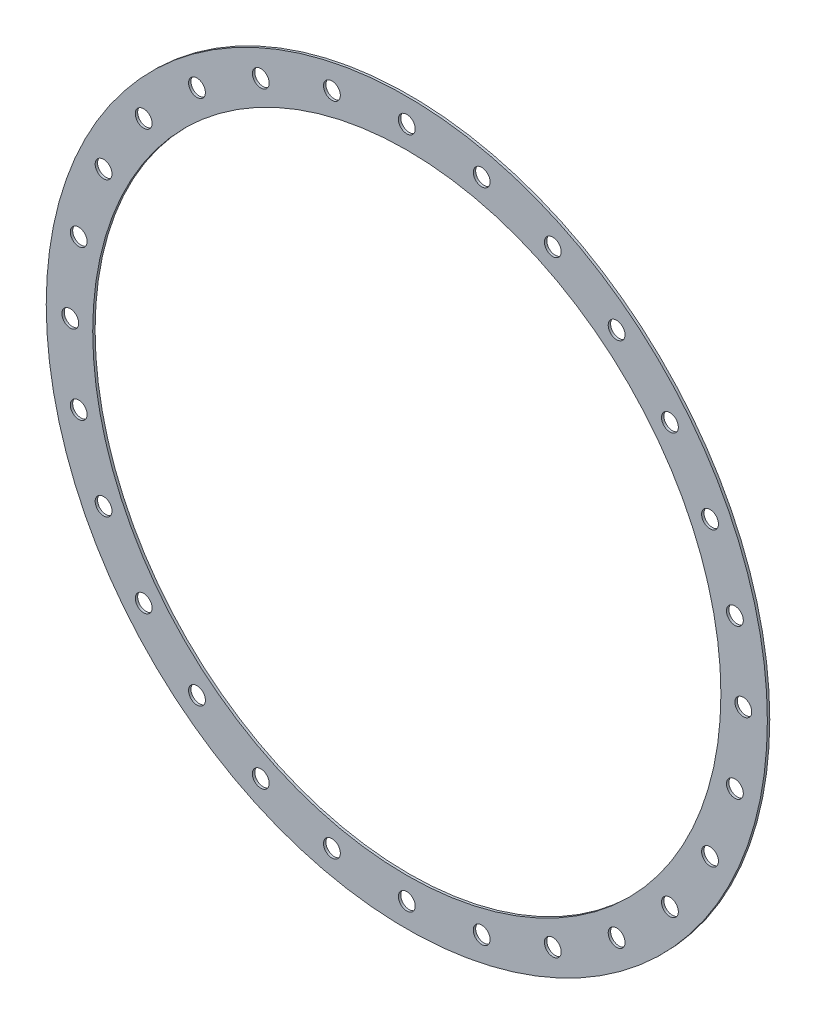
ISO-10303-21;
HEADER;
FILE_DESCRIPTION(('STEP AP214'),'2;1');
FILE_NAME('part.step','',(''),(''),'','','');
FILE_SCHEMA(('AUTOMOTIVE_DESIGN { 1 0 10303 214 1 1 1 1 }'));
ENDSEC;
DATA;
#1=APPLICATION_CONTEXT('core data for automotive mechanical design processes');
#2=APPLICATION_PROTOCOL_DEFINITION('international standard','automotive_design',2000,#1);
#3=PRODUCT_CONTEXT('',#1,'mechanical');
#4=PRODUCT('Part','Part','',(#3));
#5=PRODUCT_RELATED_PRODUCT_CATEGORY('part','',(#4));
#6=PRODUCT_DEFINITION_FORMATION('','',#4);
#7=PRODUCT_DEFINITION_CONTEXT('part definition',#1,'design');
#8=PRODUCT_DEFINITION('design','',#6,#7);
#9=PRODUCT_DEFINITION_SHAPE('','',#8);
#10=(LENGTH_UNIT() NAMED_UNIT(*) SI_UNIT(.MILLI.,.METRE.));
#11=(NAMED_UNIT(*) PLANE_ANGLE_UNIT() SI_UNIT($,.RADIAN.));
#12=(NAMED_UNIT(*) SI_UNIT($,.STERADIAN.) SOLID_ANGLE_UNIT());
#13=UNCERTAINTY_MEASURE_WITH_UNIT(LENGTH_MEASURE(1.E-05),#10,'distance_accuracy_value','');
#14=(GEOMETRIC_REPRESENTATION_CONTEXT(3) GLOBAL_UNCERTAINTY_ASSIGNED_CONTEXT((#13)) GLOBAL_UNIT_ASSIGNED_CONTEXT((#10,
#11,#12)) REPRESENTATION_CONTEXT('',''));
#15=CARTESIAN_POINT('',(0.,0.,0.));
#16=DIRECTION('',(0.,0.,1.));
#17=DIRECTION('',(1.,0.,0.));
#18=AXIS2_PLACEMENT_3D('',#15,#16,#17);
#19=CARTESIAN_POINT('',(0.,0.,1.5));
#20=DIRECTION('',(0.,0.,1.));
#21=DIRECTION('',(1.,0.,0.));
#22=AXIS2_PLACEMENT_3D('',#19,#20,#21);
#23=PLANE('',#22);
#24=CARTESIAN_POINT('',(46.7293961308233,204.734861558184,1.5));
#25=DIRECTION('',(0.,0.,1.));
#26=DIRECTION('',(0.974927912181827,-0.222520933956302,0.));
#27=AXIS2_PLACEMENT_3D('',#24,#25,#26);
#28=CIRCLE('',#27,5.25);
#29=CARTESIAN_POINT('',(51.8477676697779,203.566626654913,1.5));
#30=VERTEX_POINT('',#29);
#31=EDGE_CURVE('E210',#30,#30,#28,.T.);
#32=ORIENTED_EDGE('',*,*,#31,.F.);
#33=EDGE_LOOP('',(#32));
#34=FACE_BOUND('',#33,.T.);
#35=CARTESIAN_POINT('',(91.1155852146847,189.203462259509,1.5));
#36=DIRECTION('',(0.,0.,1.));
#37=DIRECTION('',(0.900968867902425,-0.433883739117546,0.));
#38=AXIS2_PLACEMENT_3D('',#35,#36,#37);
#39=CIRCLE('',#38,5.25);
#40=CARTESIAN_POINT('',(95.8456717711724,186.925572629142,1.5));
#41=VERTEX_POINT('',#40);
#42=EDGE_CURVE('E204',#41,#41,#39,.T.);
#43=ORIENTED_EDGE('',*,*,#42,.F.);
#44=EDGE_LOOP('',(#43));
#45=FACE_BOUND('',#44,.T.);
#46=CARTESIAN_POINT('',(130.932858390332,164.184611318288,1.5));
#47=DIRECTION('',(0.,0.,1.));
#48=DIRECTION('',(0.781831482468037,-0.623489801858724,0.));
#49=AXIS2_PLACEMENT_3D('',#46,#47,#48);
#50=CIRCLE('',#49,5.25);
#51=CARTESIAN_POINT('',(135.037473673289,160.91128985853,1.5));
#52=VERTEX_POINT('',#51);
#53=EDGE_CURVE('E198',#52,#52,#50,.T.);
#54=ORIENTED_EDGE('',*,*,#53,.F.);
#55=EDGE_LOOP('',(#54));
#56=FACE_BOUND('',#55,.T.);
#57=CARTESIAN_POINT('',(164.184611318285,130.932858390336,1.5));
#58=DIRECTION('',(0.,0.,1.));
#59=DIRECTION('',(0.623489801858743,-0.781831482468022,0.));
#60=AXIS2_PLACEMENT_3D('',#57,#58,#59);
#61=CIRCLE('',#60,5.25);
#62=CARTESIAN_POINT('',(167.457932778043,126.828243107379,1.5));
#63=VERTEX_POINT('',#62);
#64=EDGE_CURVE('E192',#63,#63,#61,.T.);
#65=ORIENTED_EDGE('',*,*,#64,.F.);
#66=EDGE_LOOP('',(#65));
#67=FACE_BOUND('',#66,.T.);
#68=CARTESIAN_POINT('',(189.203462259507,91.1155852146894,1.5));
#69=DIRECTION('',(0.,0.,1.));
#70=DIRECTION('',(0.433883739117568,-0.900968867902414,0.));
#71=AXIS2_PLACEMENT_3D('',#68,#69,#70);
#72=CIRCLE('',#71,5.25);
#73=CARTESIAN_POINT('',(191.481351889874,86.3854986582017,1.5));
#74=VERTEX_POINT('',#73);
#75=EDGE_CURVE('E186',#74,#74,#72,.T.);
#76=ORIENTED_EDGE('',*,*,#75,.F.);
#77=EDGE_LOOP('',(#76));
#78=FACE_BOUND('',#77,.T.);
#79=CARTESIAN_POINT('',(204.734861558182,46.7293961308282,1.5));
#80=DIRECTION('',(0.,0.,1.));
#81=DIRECTION('',(0.222520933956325,-0.974927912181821,0.));
#82=AXIS2_PLACEMENT_3D('',#79,#80,#81);
#83=CIRCLE('',#82,5.25);
#84=CARTESIAN_POINT('',(205.903096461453,41.6110245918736,1.5));
#85=VERTEX_POINT('',#84);
#86=EDGE_CURVE('E180',#85,#85,#83,.T.);
#87=ORIENTED_EDGE('',*,*,#86,.F.);
#88=EDGE_LOOP('',(#87));
#89=FACE_BOUND('',#88,.T.);
#90=CARTESIAN_POINT('',(210.,2.19963324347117E-12,1.5));
#91=DIRECTION('',(0.,0.,1.));
#92=DIRECTION('',(0.,-1.,0.));
#93=AXIS2_PLACEMENT_3D('',#90,#91,#92);
#94=CIRCLE('',#93,5.25);
#95=CARTESIAN_POINT('',(210.,-5.2499999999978,1.5));
#96=VERTEX_POINT('',#95);
#97=EDGE_CURVE('E174',#96,#96,#94,.T.);
#98=ORIENTED_EDGE('',*,*,#97,.F.);
#99=EDGE_LOOP('',(#98));
#100=FACE_BOUND('',#99,.T.);
#101=CARTESIAN_POINT('',(204.734861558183,-46.7293961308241,1.5));
#102=DIRECTION('',(0.,0.,1.));
#103=DIRECTION('',(-0.222520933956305,-0.974927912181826,0.));
#104=AXIS2_PLACEMENT_3D('',#101,#102,#103);
#105=CIRCLE('',#104,5.25);
#106=CARTESIAN_POINT('',(203.566626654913,-51.8477676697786,1.5));
#107=VERTEX_POINT('',#106);
#108=EDGE_CURVE('E168',#107,#107,#105,.T.);
#109=ORIENTED_EDGE('',*,*,#108,.F.);
#110=EDGE_LOOP('',(#109));
#111=FACE_BOUND('',#110,.T.);
#112=CARTESIAN_POINT('',(189.203462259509,-91.1155852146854,1.5));
#113=DIRECTION('',(0.,0.,1.));
#114=DIRECTION('',(-0.433883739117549,-0.900968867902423,0.));
#115=AXIS2_PLACEMENT_3D('',#112,#113,#114);
#116=CIRCLE('',#115,5.25);
#117=CARTESIAN_POINT('',(186.925572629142,-95.8456717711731,1.5));
#118=VERTEX_POINT('',#117);
#119=EDGE_CURVE('E162',#118,#118,#116,.T.);
#120=ORIENTED_EDGE('',*,*,#119,.F.);
#121=EDGE_LOOP('',(#120));
#122=FACE_BOUND('',#121,.T.);
#123=CARTESIAN_POINT('',(164.184611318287,-130.932858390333,1.5));
#124=DIRECTION('',(0.,0.,1.));
#125=DIRECTION('',(-0.623489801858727,-0.781831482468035,0.));
#126=AXIS2_PLACEMENT_3D('',#123,#124,#125);
#127=CIRCLE('',#126,5.25);
#128=CARTESIAN_POINT('',(160.911289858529,-135.03747367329,1.5));
#129=VERTEX_POINT('',#128);
#130=EDGE_CURVE('E156',#129,#129,#127,.T.);
#131=ORIENTED_EDGE('',*,*,#130,.F.);
#132=EDGE_LOOP('',(#131));
#133=FACE_BOUND('',#132,.T.);
#134=CARTESIAN_POINT('',(130.932858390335,-164.184611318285,1.5));
#135=DIRECTION('',(0.,0.,1.));
#136=DIRECTION('',(-0.781831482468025,-0.62348980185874,0.));
#137=AXIS2_PLACEMENT_3D('',#134,#135,#136);
#138=CIRCLE('',#137,5.25);
#139=CARTESIAN_POINT('',(126.828243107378,-167.457932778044,1.5));
#140=VERTEX_POINT('',#139);
#141=EDGE_CURVE('E150',#140,#140,#138,.T.);
#142=ORIENTED_EDGE('',*,*,#141,.F.);
#143=EDGE_LOOP('',(#142));
#144=FACE_BOUND('',#143,.T.);
#145=CARTESIAN_POINT('',(91.1155852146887,-189.203462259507,1.5));
#146=DIRECTION('',(0.,0.,1.));
#147=DIRECTION('',(-0.900968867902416,-0.433883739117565,0.));
#148=AXIS2_PLACEMENT_3D('',#145,#146,#147);
#149=CIRCLE('',#148,5.25);
#150=CARTESIAN_POINT('',(86.385498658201,-191.481351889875,1.5));
#151=VERTEX_POINT('',#150);
#152=EDGE_CURVE('E144',#151,#151,#149,.T.);
#153=ORIENTED_EDGE('',*,*,#152,.F.);
#154=EDGE_LOOP('',(#153));
#155=FACE_BOUND('',#154,.T.);
#156=CARTESIAN_POINT('',(46.7293961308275,-204.734861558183,1.5));
#157=DIRECTION('',(0.,0.,1.));
#158=DIRECTION('',(-0.974927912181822,-0.222520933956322,0.));
#159=AXIS2_PLACEMENT_3D('',#156,#157,#158);
#160=CIRCLE('',#159,5.25);
#161=CARTESIAN_POINT('',(41.611024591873,-205.903096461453,1.5));
#162=VERTEX_POINT('',#161);
#163=EDGE_CURVE('E138',#162,#162,#160,.T.);
#164=ORIENTED_EDGE('',*,*,#163,.F.);
#165=EDGE_LOOP('',(#164));
#166=FACE_BOUND('',#165,.T.);
#167=CARTESIAN_POINT('',(0.,-210.,1.5));
#168=DIRECTION('',(0.,0.,1.));
#169=DIRECTION('',(-1.,0.,0.));
#170=AXIS2_PLACEMENT_3D('',#167,#168,#169);
#171=CIRCLE('',#170,5.25);
#172=CARTESIAN_POINT('',(-5.25,-210.,1.5));
#173=VERTEX_POINT('',#172);
#174=EDGE_CURVE('E132',#173,#173,#171,.T.);
#175=ORIENTED_EDGE('',*,*,#174,.F.);
#176=EDGE_LOOP('',(#175));
#177=FACE_BOUND('',#176,.T.);
#178=CARTESIAN_POINT('',(-46.7293961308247,-204.734861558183,1.5));
#179=DIRECTION('',(0.,0.,1.));
#180=DIRECTION('',(-0.974927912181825,0.222520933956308,0.));
#181=AXIS2_PLACEMENT_3D('',#178,#179,#180);
#182=CIRCLE('',#181,5.25);
#183=CARTESIAN_POINT('',(-51.8477676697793,-203.566626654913,1.5));
#184=VERTEX_POINT('',#183);
#185=EDGE_CURVE('E126',#184,#184,#182,.T.);
#186=ORIENTED_EDGE('',*,*,#185,.F.);
#187=EDGE_LOOP('',(#186));
#188=FACE_BOUND('',#187,.T.);
#189=CARTESIAN_POINT('',(-91.115585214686,-189.203462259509,1.5));
#190=DIRECTION('',(0.,0.,1.));
#191=DIRECTION('',(-0.900968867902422,0.433883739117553,0.));
#192=AXIS2_PLACEMENT_3D('',#189,#190,#191);
#193=CIRCLE('',#192,5.25);
#194=CARTESIAN_POINT('',(-95.8456717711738,-186.925572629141,1.5));
#195=VERTEX_POINT('',#194);
#196=EDGE_CURVE('E120',#195,#195,#193,.T.);
#197=ORIENTED_EDGE('',*,*,#196,.F.);
#198=EDGE_LOOP('',(#197));
#199=FACE_BOUND('',#198,.T.);
#200=CARTESIAN_POINT('',(-130.932858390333,-164.184611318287,1.5));
#201=DIRECTION('',(0.,0.,1.));
#202=DIRECTION('',(-0.781831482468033,0.623489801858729,0.));
#203=AXIS2_PLACEMENT_3D('',#200,#201,#202);
#204=CIRCLE('',#203,5.25);
#205=CARTESIAN_POINT('',(-135.03747367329,-160.911289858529,1.5));
#206=VERTEX_POINT('',#205);
#207=EDGE_CURVE('E114',#206,#206,#204,.T.);
#208=ORIENTED_EDGE('',*,*,#207,.F.);
#209=EDGE_LOOP('',(#208));
#210=FACE_BOUND('',#209,.T.);
#211=CARTESIAN_POINT('',(-164.184611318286,-130.932858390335,1.5));
#212=DIRECTION('',(0.,0.,1.));
#213=DIRECTION('',(-0.623489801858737,0.781831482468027,0.));
#214=AXIS2_PLACEMENT_3D('',#211,#212,#213);
#215=CIRCLE('',#214,5.25);
#216=CARTESIAN_POINT('',(-167.457932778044,-126.828243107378,1.5));
#217=VERTEX_POINT('',#216);
#218=EDGE_CURVE('E108',#217,#217,#215,.T.);
#219=ORIENTED_EDGE('',*,*,#218,.F.);
#220=EDGE_LOOP('',(#219));
#221=FACE_BOUND('',#220,.T.);
#222=CARTESIAN_POINT('',(-189.203462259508,-91.115585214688,1.5));
#223=DIRECTION('',(0.,0.,1.));
#224=DIRECTION('',(-0.433883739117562,0.900968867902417,0.));
#225=AXIS2_PLACEMENT_3D('',#222,#223,#224);
#226=CIRCLE('',#225,5.25);
#227=CARTESIAN_POINT('',(-191.481351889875,-86.3854986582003,1.5));
#228=VERTEX_POINT('',#227);
#229=EDGE_CURVE('E102',#228,#228,#226,.T.);
#230=ORIENTED_EDGE('',*,*,#229,.F.);
#231=EDGE_LOOP('',(#230));
#232=FACE_BOUND('',#231,.T.);
#233=CARTESIAN_POINT('',(-204.734861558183,-46.7293961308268,1.5));
#234=DIRECTION('',(0.,0.,1.));
#235=DIRECTION('',(-0.222520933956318,0.974927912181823,0.));
#236=AXIS2_PLACEMENT_3D('',#233,#234,#235);
#237=CIRCLE('',#236,5.25);
#238=CARTESIAN_POINT('',(-205.903096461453,-41.6110245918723,1.5));
#239=VERTEX_POINT('',#238);
#240=EDGE_CURVE('E96',#239,#239,#237,.T.);
#241=ORIENTED_EDGE('',*,*,#240,.F.);
#242=EDGE_LOOP('',(#241));
#243=FACE_BOUND('',#242,.T.);
#244=CARTESIAN_POINT('',(-210.,-7.33211081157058E-13,1.5));
#245=DIRECTION('',(0.,0.,1.));
#246=DIRECTION('',(0.,1.,0.));
#247=AXIS2_PLACEMENT_3D('',#244,#245,#246);
#248=CIRCLE('',#247,5.25);
#249=CARTESIAN_POINT('',(-210.,5.24999999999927,1.5));
#250=VERTEX_POINT('',#249);
#251=EDGE_CURVE('E90',#250,#250,#248,.T.);
#252=ORIENTED_EDGE('',*,*,#251,.F.);
#253=EDGE_LOOP('',(#252));
#254=FACE_BOUND('',#253,.T.);
#255=CARTESIAN_POINT('',(-204.734861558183,46.7293961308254,1.5));
#256=DIRECTION('',(0.,0.,1.));
#257=DIRECTION('',(0.222520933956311,0.974927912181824,0.));
#258=AXIS2_PLACEMENT_3D('',#255,#256,#257);
#259=CIRCLE('',#258,5.25);
#260=CARTESIAN_POINT('',(-203.566626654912,51.84776766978,1.5));
#261=VERTEX_POINT('',#260);
#262=EDGE_CURVE('E84',#261,#261,#259,.T.);
#263=ORIENTED_EDGE('',*,*,#262,.F.);
#264=EDGE_LOOP('',(#263));
#265=FACE_BOUND('',#264,.T.);
#266=CARTESIAN_POINT('',(-189.203462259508,91.1155852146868,1.5));
#267=DIRECTION('',(0.,0.,1.));
#268=DIRECTION('',(0.433883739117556,0.90096886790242,0.));
#269=AXIS2_PLACEMENT_3D('',#266,#267,#268);
#270=CIRCLE('',#269,5.25);
#271=CARTESIAN_POINT('',(-186.925572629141,95.8456717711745,1.5));
#272=VERTEX_POINT('',#271);
#273=EDGE_CURVE('E78',#272,#272,#270,.T.);
#274=ORIENTED_EDGE('',*,*,#273,.F.);
#275=EDGE_LOOP('',(#274));
#276=FACE_BOUND('',#275,.T.);
#277=CARTESIAN_POINT('',(-164.184611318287,130.932858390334,1.5));
#278=DIRECTION('',(0.,0.,1.));
#279=DIRECTION('',(0.623489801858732,0.781831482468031,0.));
#280=AXIS2_PLACEMENT_3D('',#277,#278,#279);
#281=CIRCLE('',#280,5.25);
#282=CARTESIAN_POINT('',(-160.911289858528,135.037473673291,1.5));
#283=VERTEX_POINT('',#282);
#284=EDGE_CURVE('E72',#283,#283,#281,.T.);
#285=ORIENTED_EDGE('',*,*,#284,.F.);
#286=EDGE_LOOP('',(#285));
#287=FACE_BOUND('',#286,.T.);
#288=CARTESIAN_POINT('',(-130.932858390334,164.184611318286,1.5));
#289=DIRECTION('',(0.,0.,1.));
#290=DIRECTION('',(0.781831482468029,0.623489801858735,0.));
#291=AXIS2_PLACEMENT_3D('',#288,#289,#290);
#292=CIRCLE('',#291,5.25);
#293=CARTESIAN_POINT('',(-126.828243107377,167.457932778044,1.5));
#294=VERTEX_POINT('',#293);
#295=EDGE_CURVE('E66',#294,#294,#292,.T.);
#296=ORIENTED_EDGE('',*,*,#295,.F.);
#297=EDGE_LOOP('',(#296));
#298=FACE_BOUND('',#297,.T.);
#299=CARTESIAN_POINT('',(-91.1155852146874,189.203462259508,1.5));
#300=DIRECTION('',(0.,0.,1.));
#301=DIRECTION('',(0.900968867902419,0.433883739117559,0.));
#302=AXIS2_PLACEMENT_3D('',#299,#300,#301);
#303=CIRCLE('',#302,5.25);
#304=CARTESIAN_POINT('',(-86.3854986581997,191.481351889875,1.5));
#305=VERTEX_POINT('',#304);
#306=EDGE_CURVE('E60',#305,#305,#303,.T.);
#307=ORIENTED_EDGE('',*,*,#306,.F.);
#308=EDGE_LOOP('',(#307));
#309=FACE_BOUND('',#308,.T.);
#310=CARTESIAN_POINT('',(-46.7293961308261,204.734861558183,1.5));
#311=DIRECTION('',(0.,0.,1.));
#312=DIRECTION('',(0.974927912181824,0.222520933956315,0.));
#313=AXIS2_PLACEMENT_3D('',#310,#311,#312);
#314=CIRCLE('',#313,5.25);
#315=CARTESIAN_POINT('',(-41.6110245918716,205.903096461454,1.5));
#316=VERTEX_POINT('',#315);
#317=EDGE_CURVE('E54',#316,#316,#314,.T.);
#318=ORIENTED_EDGE('',*,*,#317,.F.);
#319=EDGE_LOOP('',(#318));
#320=FACE_BOUND('',#319,.T.);
#321=CARTESIAN_POINT('',(0.,210.,1.5));
#322=DIRECTION('',(0.,0.,1.));
#323=DIRECTION('',(1.,0.,0.));
#324=AXIS2_PLACEMENT_3D('',#321,#322,#323);
#325=CIRCLE('',#324,5.25);
#326=CARTESIAN_POINT('',(5.25,210.,1.5));
#327=VERTEX_POINT('',#326);
#328=EDGE_CURVE('E48',#327,#327,#325,.T.);
#329=ORIENTED_EDGE('',*,*,#328,.F.);
#330=EDGE_LOOP('',(#329));
#331=FACE_BOUND('',#330,.T.);
#332=CARTESIAN_POINT('',(0.,0.,1.5));
#333=DIRECTION('',(0.,0.,1.));
#334=DIRECTION('',(1.,0.,0.));
#335=AXIS2_PLACEMENT_3D('',#332,#333,#334);
#336=CIRCLE('',#335,225.);
#337=CARTESIAN_POINT('',(225.,0.,1.5));
#338=VERTEX_POINT('',#337);
#339=EDGE_CURVE('E10',#338,#338,#336,.T.);
#340=ORIENTED_EDGE('',*,*,#339,.T.);
#341=EDGE_LOOP('',(#340));
#342=FACE_BOUND('',#341,.T.);
#343=CARTESIAN_POINT('',(0.,0.,1.5));
#344=DIRECTION('',(0.,0.,1.));
#345=DIRECTION('',(1.,0.,0.));
#346=AXIS2_PLACEMENT_3D('',#343,#344,#345);
#347=CIRCLE('',#346,196.);
#348=CARTESIAN_POINT('',(196.,0.,1.5));
#349=VERTEX_POINT('',#348);
#350=EDGE_CURVE('E40',#349,#349,#347,.T.);
#351=ORIENTED_EDGE('',*,*,#350,.F.);
#352=EDGE_LOOP('',(#351));
#353=FACE_BOUND('',#352,.T.);
#354=ADVANCED_FACE('F29',(#34,#45,#56,#67,#78,#89,#100,#111,#122,#133,#144,#155,#166,#177,#188,
#199,#210,#221,#232,#243,#254,#265,#276,#287,#298,#309,#320,#331,#342,#353),#23,.T.);
#355=CARTESIAN_POINT('',(0.,0.,0.));
#356=DIRECTION('',(0.,0.,1.));
#357=DIRECTION('',(1.,0.,0.));
#358=AXIS2_PLACEMENT_3D('',#355,#356,#357);
#359=PLANE('',#358);
#360=CARTESIAN_POINT('',(46.7293961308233,204.734861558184,0.));
#361=DIRECTION('',(0.,0.,1.));
#362=DIRECTION('',(0.974927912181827,-0.222520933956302,0.));
#363=AXIS2_PLACEMENT_3D('',#360,#361,#362);
#364=CIRCLE('',#363,5.25);
#365=CARTESIAN_POINT('',(51.8477676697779,203.566626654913,0.));
#366=VERTEX_POINT('',#365);
#367=EDGE_CURVE('E207',#366,#366,#364,.T.);
#368=ORIENTED_EDGE('',*,*,#367,.T.);
#369=EDGE_LOOP('',(#368));
#370=FACE_BOUND('',#369,.T.);
#371=CARTESIAN_POINT('',(91.1155852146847,189.203462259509,0.));
#372=DIRECTION('',(0.,0.,1.));
#373=DIRECTION('',(0.900968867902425,-0.433883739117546,0.));
#374=AXIS2_PLACEMENT_3D('',#371,#372,#373);
#375=CIRCLE('',#374,5.25);
#376=CARTESIAN_POINT('',(95.8456717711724,186.925572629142,0.));
#377=VERTEX_POINT('',#376);
#378=EDGE_CURVE('E201',#377,#377,#375,.T.);
#379=ORIENTED_EDGE('',*,*,#378,.T.);
#380=EDGE_LOOP('',(#379));
#381=FACE_BOUND('',#380,.T.);
#382=CARTESIAN_POINT('',(130.932858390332,164.184611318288,0.));
#383=DIRECTION('',(0.,0.,1.));
#384=DIRECTION('',(0.781831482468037,-0.623489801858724,0.));
#385=AXIS2_PLACEMENT_3D('',#382,#383,#384);
#386=CIRCLE('',#385,5.25);
#387=CARTESIAN_POINT('',(135.037473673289,160.91128985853,0.));
#388=VERTEX_POINT('',#387);
#389=EDGE_CURVE('E195',#388,#388,#386,.T.);
#390=ORIENTED_EDGE('',*,*,#389,.T.);
#391=EDGE_LOOP('',(#390));
#392=FACE_BOUND('',#391,.T.);
#393=CARTESIAN_POINT('',(164.184611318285,130.932858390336,0.));
#394=DIRECTION('',(0.,0.,1.));
#395=DIRECTION('',(0.623489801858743,-0.781831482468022,0.));
#396=AXIS2_PLACEMENT_3D('',#393,#394,#395);
#397=CIRCLE('',#396,5.25);
#398=CARTESIAN_POINT('',(167.457932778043,126.828243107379,0.));
#399=VERTEX_POINT('',#398);
#400=EDGE_CURVE('E189',#399,#399,#397,.T.);
#401=ORIENTED_EDGE('',*,*,#400,.T.);
#402=EDGE_LOOP('',(#401));
#403=FACE_BOUND('',#402,.T.);
#404=CARTESIAN_POINT('',(189.203462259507,91.1155852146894,0.));
#405=DIRECTION('',(0.,0.,1.));
#406=DIRECTION('',(0.433883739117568,-0.900968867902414,0.));
#407=AXIS2_PLACEMENT_3D('',#404,#405,#406);
#408=CIRCLE('',#407,5.25);
#409=CARTESIAN_POINT('',(191.481351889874,86.3854986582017,0.));
#410=VERTEX_POINT('',#409);
#411=EDGE_CURVE('E183',#410,#410,#408,.T.);
#412=ORIENTED_EDGE('',*,*,#411,.T.);
#413=EDGE_LOOP('',(#412));
#414=FACE_BOUND('',#413,.T.);
#415=CARTESIAN_POINT('',(204.734861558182,46.7293961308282,0.));
#416=DIRECTION('',(0.,0.,1.));
#417=DIRECTION('',(0.222520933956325,-0.974927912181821,0.));
#418=AXIS2_PLACEMENT_3D('',#415,#416,#417);
#419=CIRCLE('',#418,5.25);
#420=CARTESIAN_POINT('',(205.903096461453,41.6110245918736,0.));
#421=VERTEX_POINT('',#420);
#422=EDGE_CURVE('E177',#421,#421,#419,.T.);
#423=ORIENTED_EDGE('',*,*,#422,.T.);
#424=EDGE_LOOP('',(#423));
#425=FACE_BOUND('',#424,.T.);
#426=CARTESIAN_POINT('',(210.,2.19963324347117E-12,0.));
#427=DIRECTION('',(0.,0.,1.));
#428=DIRECTION('',(0.,-1.,0.));
#429=AXIS2_PLACEMENT_3D('',#426,#427,#428);
#430=CIRCLE('',#429,5.25);
#431=CARTESIAN_POINT('',(210.,-5.2499999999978,0.));
#432=VERTEX_POINT('',#431);
#433=EDGE_CURVE('E171',#432,#432,#430,.T.);
#434=ORIENTED_EDGE('',*,*,#433,.T.);
#435=EDGE_LOOP('',(#434));
#436=FACE_BOUND('',#435,.T.);
#437=CARTESIAN_POINT('',(204.734861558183,-46.7293961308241,0.));
#438=DIRECTION('',(0.,0.,1.));
#439=DIRECTION('',(-0.222520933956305,-0.974927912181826,0.));
#440=AXIS2_PLACEMENT_3D('',#437,#438,#439);
#441=CIRCLE('',#440,5.25);
#442=CARTESIAN_POINT('',(203.566626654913,-51.8477676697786,0.));
#443=VERTEX_POINT('',#442);
#444=EDGE_CURVE('E165',#443,#443,#441,.T.);
#445=ORIENTED_EDGE('',*,*,#444,.T.);
#446=EDGE_LOOP('',(#445));
#447=FACE_BOUND('',#446,.T.);
#448=CARTESIAN_POINT('',(189.203462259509,-91.1155852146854,0.));
#449=DIRECTION('',(0.,0.,1.));
#450=DIRECTION('',(-0.433883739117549,-0.900968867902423,0.));
#451=AXIS2_PLACEMENT_3D('',#448,#449,#450);
#452=CIRCLE('',#451,5.25);
#453=CARTESIAN_POINT('',(186.925572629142,-95.8456717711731,0.));
#454=VERTEX_POINT('',#453);
#455=EDGE_CURVE('E159',#454,#454,#452,.T.);
#456=ORIENTED_EDGE('',*,*,#455,.T.);
#457=EDGE_LOOP('',(#456));
#458=FACE_BOUND('',#457,.T.);
#459=CARTESIAN_POINT('',(164.184611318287,-130.932858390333,0.));
#460=DIRECTION('',(0.,0.,1.));
#461=DIRECTION('',(-0.623489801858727,-0.781831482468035,0.));
#462=AXIS2_PLACEMENT_3D('',#459,#460,#461);
#463=CIRCLE('',#462,5.25);
#464=CARTESIAN_POINT('',(160.911289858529,-135.03747367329,0.));
#465=VERTEX_POINT('',#464);
#466=EDGE_CURVE('E153',#465,#465,#463,.T.);
#467=ORIENTED_EDGE('',*,*,#466,.T.);
#468=EDGE_LOOP('',(#467));
#469=FACE_BOUND('',#468,.T.);
#470=CARTESIAN_POINT('',(130.932858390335,-164.184611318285,0.));
#471=DIRECTION('',(0.,0.,1.));
#472=DIRECTION('',(-0.781831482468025,-0.62348980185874,0.));
#473=AXIS2_PLACEMENT_3D('',#470,#471,#472);
#474=CIRCLE('',#473,5.25);
#475=CARTESIAN_POINT('',(126.828243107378,-167.457932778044,0.));
#476=VERTEX_POINT('',#475);
#477=EDGE_CURVE('E147',#476,#476,#474,.T.);
#478=ORIENTED_EDGE('',*,*,#477,.T.);
#479=EDGE_LOOP('',(#478));
#480=FACE_BOUND('',#479,.T.);
#481=CARTESIAN_POINT('',(91.1155852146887,-189.203462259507,0.));
#482=DIRECTION('',(0.,0.,1.));
#483=DIRECTION('',(-0.900968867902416,-0.433883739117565,0.));
#484=AXIS2_PLACEMENT_3D('',#481,#482,#483);
#485=CIRCLE('',#484,5.25);
#486=CARTESIAN_POINT('',(86.385498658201,-191.481351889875,0.));
#487=VERTEX_POINT('',#486);
#488=EDGE_CURVE('E141',#487,#487,#485,.T.);
#489=ORIENTED_EDGE('',*,*,#488,.T.);
#490=EDGE_LOOP('',(#489));
#491=FACE_BOUND('',#490,.T.);
#492=CARTESIAN_POINT('',(46.7293961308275,-204.734861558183,0.));
#493=DIRECTION('',(0.,0.,1.));
#494=DIRECTION('',(-0.974927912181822,-0.222520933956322,0.));
#495=AXIS2_PLACEMENT_3D('',#492,#493,#494);
#496=CIRCLE('',#495,5.25);
#497=CARTESIAN_POINT('',(41.611024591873,-205.903096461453,0.));
#498=VERTEX_POINT('',#497);
#499=EDGE_CURVE('E135',#498,#498,#496,.T.);
#500=ORIENTED_EDGE('',*,*,#499,.T.);
#501=EDGE_LOOP('',(#500));
#502=FACE_BOUND('',#501,.T.);
#503=CARTESIAN_POINT('',(0.,-210.,0.));
#504=DIRECTION('',(0.,0.,1.));
#505=DIRECTION('',(-1.,0.,0.));
#506=AXIS2_PLACEMENT_3D('',#503,#504,#505);
#507=CIRCLE('',#506,5.25);
#508=CARTESIAN_POINT('',(-5.25,-210.,0.));
#509=VERTEX_POINT('',#508);
#510=EDGE_CURVE('E129',#509,#509,#507,.T.);
#511=ORIENTED_EDGE('',*,*,#510,.T.);
#512=EDGE_LOOP('',(#511));
#513=FACE_BOUND('',#512,.T.);
#514=CARTESIAN_POINT('',(-46.7293961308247,-204.734861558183,0.));
#515=DIRECTION('',(0.,0.,1.));
#516=DIRECTION('',(-0.974927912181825,0.222520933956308,0.));
#517=AXIS2_PLACEMENT_3D('',#514,#515,#516);
#518=CIRCLE('',#517,5.25);
#519=CARTESIAN_POINT('',(-51.8477676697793,-203.566626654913,0.));
#520=VERTEX_POINT('',#519);
#521=EDGE_CURVE('E123',#520,#520,#518,.T.);
#522=ORIENTED_EDGE('',*,*,#521,.T.);
#523=EDGE_LOOP('',(#522));
#524=FACE_BOUND('',#523,.T.);
#525=CARTESIAN_POINT('',(-91.115585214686,-189.203462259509,0.));
#526=DIRECTION('',(0.,0.,1.));
#527=DIRECTION('',(-0.900968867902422,0.433883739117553,0.));
#528=AXIS2_PLACEMENT_3D('',#525,#526,#527);
#529=CIRCLE('',#528,5.25);
#530=CARTESIAN_POINT('',(-95.8456717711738,-186.925572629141,0.));
#531=VERTEX_POINT('',#530);
#532=EDGE_CURVE('E117',#531,#531,#529,.T.);
#533=ORIENTED_EDGE('',*,*,#532,.T.);
#534=EDGE_LOOP('',(#533));
#535=FACE_BOUND('',#534,.T.);
#536=CARTESIAN_POINT('',(-130.932858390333,-164.184611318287,0.));
#537=DIRECTION('',(0.,0.,1.));
#538=DIRECTION('',(-0.781831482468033,0.623489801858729,0.));
#539=AXIS2_PLACEMENT_3D('',#536,#537,#538);
#540=CIRCLE('',#539,5.25);
#541=CARTESIAN_POINT('',(-135.03747367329,-160.911289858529,0.));
#542=VERTEX_POINT('',#541);
#543=EDGE_CURVE('E111',#542,#542,#540,.T.);
#544=ORIENTED_EDGE('',*,*,#543,.T.);
#545=EDGE_LOOP('',(#544));
#546=FACE_BOUND('',#545,.T.);
#547=CARTESIAN_POINT('',(-164.184611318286,-130.932858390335,0.));
#548=DIRECTION('',(0.,0.,1.));
#549=DIRECTION('',(-0.623489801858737,0.781831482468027,0.));
#550=AXIS2_PLACEMENT_3D('',#547,#548,#549);
#551=CIRCLE('',#550,5.25);
#552=CARTESIAN_POINT('',(-167.457932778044,-126.828243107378,0.));
#553=VERTEX_POINT('',#552);
#554=EDGE_CURVE('E105',#553,#553,#551,.T.);
#555=ORIENTED_EDGE('',*,*,#554,.T.);
#556=EDGE_LOOP('',(#555));
#557=FACE_BOUND('',#556,.T.);
#558=CARTESIAN_POINT('',(-189.203462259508,-91.115585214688,0.));
#559=DIRECTION('',(0.,0.,1.));
#560=DIRECTION('',(-0.433883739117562,0.900968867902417,0.));
#561=AXIS2_PLACEMENT_3D('',#558,#559,#560);
#562=CIRCLE('',#561,5.25);
#563=CARTESIAN_POINT('',(-191.481351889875,-86.3854986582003,0.));
#564=VERTEX_POINT('',#563);
#565=EDGE_CURVE('E99',#564,#564,#562,.T.);
#566=ORIENTED_EDGE('',*,*,#565,.T.);
#567=EDGE_LOOP('',(#566));
#568=FACE_BOUND('',#567,.T.);
#569=CARTESIAN_POINT('',(-204.734861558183,-46.7293961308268,0.));
#570=DIRECTION('',(0.,0.,1.));
#571=DIRECTION('',(-0.222520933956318,0.974927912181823,0.));
#572=AXIS2_PLACEMENT_3D('',#569,#570,#571);
#573=CIRCLE('',#572,5.25);
#574=CARTESIAN_POINT('',(-205.903096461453,-41.6110245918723,0.));
#575=VERTEX_POINT('',#574);
#576=EDGE_CURVE('E93',#575,#575,#573,.T.);
#577=ORIENTED_EDGE('',*,*,#576,.T.);
#578=EDGE_LOOP('',(#577));
#579=FACE_BOUND('',#578,.T.);
#580=CARTESIAN_POINT('',(-210.,-7.33211081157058E-13,0.));
#581=DIRECTION('',(0.,0.,1.));
#582=DIRECTION('',(0.,1.,0.));
#583=AXIS2_PLACEMENT_3D('',#580,#581,#582);
#584=CIRCLE('',#583,5.25);
#585=CARTESIAN_POINT('',(-210.,5.24999999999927,0.));
#586=VERTEX_POINT('',#585);
#587=EDGE_CURVE('E87',#586,#586,#584,.T.);
#588=ORIENTED_EDGE('',*,*,#587,.T.);
#589=EDGE_LOOP('',(#588));
#590=FACE_BOUND('',#589,.T.);
#591=CARTESIAN_POINT('',(-204.734861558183,46.7293961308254,0.));
#592=DIRECTION('',(0.,0.,1.));
#593=DIRECTION('',(0.222520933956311,0.974927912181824,0.));
#594=AXIS2_PLACEMENT_3D('',#591,#592,#593);
#595=CIRCLE('',#594,5.25);
#596=CARTESIAN_POINT('',(-203.566626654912,51.84776766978,0.));
#597=VERTEX_POINT('',#596);
#598=EDGE_CURVE('E81',#597,#597,#595,.T.);
#599=ORIENTED_EDGE('',*,*,#598,.T.);
#600=EDGE_LOOP('',(#599));
#601=FACE_BOUND('',#600,.T.);
#602=CARTESIAN_POINT('',(-189.203462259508,91.1155852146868,0.));
#603=DIRECTION('',(0.,0.,1.));
#604=DIRECTION('',(0.433883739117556,0.90096886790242,0.));
#605=AXIS2_PLACEMENT_3D('',#602,#603,#604);
#606=CIRCLE('',#605,5.25);
#607=CARTESIAN_POINT('',(-186.925572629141,95.8456717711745,0.));
#608=VERTEX_POINT('',#607);
#609=EDGE_CURVE('E75',#608,#608,#606,.T.);
#610=ORIENTED_EDGE('',*,*,#609,.T.);
#611=EDGE_LOOP('',(#610));
#612=FACE_BOUND('',#611,.T.);
#613=CARTESIAN_POINT('',(-164.184611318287,130.932858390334,0.));
#614=DIRECTION('',(0.,0.,1.));
#615=DIRECTION('',(0.623489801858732,0.781831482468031,0.));
#616=AXIS2_PLACEMENT_3D('',#613,#614,#615);
#617=CIRCLE('',#616,5.25);
#618=CARTESIAN_POINT('',(-160.911289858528,135.037473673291,0.));
#619=VERTEX_POINT('',#618);
#620=EDGE_CURVE('E69',#619,#619,#617,.T.);
#621=ORIENTED_EDGE('',*,*,#620,.T.);
#622=EDGE_LOOP('',(#621));
#623=FACE_BOUND('',#622,.T.);
#624=CARTESIAN_POINT('',(-130.932858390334,164.184611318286,0.));
#625=DIRECTION('',(0.,0.,1.));
#626=DIRECTION('',(0.781831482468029,0.623489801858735,0.));
#627=AXIS2_PLACEMENT_3D('',#624,#625,#626);
#628=CIRCLE('',#627,5.25);
#629=CARTESIAN_POINT('',(-126.828243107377,167.457932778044,0.));
#630=VERTEX_POINT('',#629);
#631=EDGE_CURVE('E63',#630,#630,#628,.T.);
#632=ORIENTED_EDGE('',*,*,#631,.T.);
#633=EDGE_LOOP('',(#632));
#634=FACE_BOUND('',#633,.T.);
#635=CARTESIAN_POINT('',(-91.1155852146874,189.203462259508,0.));
#636=DIRECTION('',(0.,0.,1.));
#637=DIRECTION('',(0.900968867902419,0.433883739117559,0.));
#638=AXIS2_PLACEMENT_3D('',#635,#636,#637);
#639=CIRCLE('',#638,5.25);
#640=CARTESIAN_POINT('',(-86.3854986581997,191.481351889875,0.));
#641=VERTEX_POINT('',#640);
#642=EDGE_CURVE('E57',#641,#641,#639,.T.);
#643=ORIENTED_EDGE('',*,*,#642,.T.);
#644=EDGE_LOOP('',(#643));
#645=FACE_BOUND('',#644,.T.);
#646=CARTESIAN_POINT('',(-46.7293961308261,204.734861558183,0.));
#647=DIRECTION('',(0.,0.,1.));
#648=DIRECTION('',(0.974927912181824,0.222520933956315,0.));
#649=AXIS2_PLACEMENT_3D('',#646,#647,#648);
#650=CIRCLE('',#649,5.25);
#651=CARTESIAN_POINT('',(-41.6110245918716,205.903096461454,0.));
#652=VERTEX_POINT('',#651);
#653=EDGE_CURVE('E51',#652,#652,#650,.T.);
#654=ORIENTED_EDGE('',*,*,#653,.T.);
#655=EDGE_LOOP('',(#654));
#656=FACE_BOUND('',#655,.T.);
#657=CARTESIAN_POINT('',(0.,210.,0.));
#658=DIRECTION('',(0.,0.,1.));
#659=DIRECTION('',(1.,0.,0.));
#660=AXIS2_PLACEMENT_3D('',#657,#658,#659);
#661=CIRCLE('',#660,5.25);
#662=CARTESIAN_POINT('',(5.25,210.,0.));
#663=VERTEX_POINT('',#662);
#664=EDGE_CURVE('E45',#663,#663,#661,.T.);
#665=ORIENTED_EDGE('',*,*,#664,.T.);
#666=EDGE_LOOP('',(#665));
#667=FACE_BOUND('',#666,.T.);
#668=CARTESIAN_POINT('',(0.,0.,0.));
#669=DIRECTION('',(0.,0.,1.));
#670=DIRECTION('',(1.,0.,0.));
#671=AXIS2_PLACEMENT_3D('',#668,#669,#670);
#672=CIRCLE('',#671,225.);
#673=CARTESIAN_POINT('',(225.,0.,0.));
#674=VERTEX_POINT('',#673);
#675=EDGE_CURVE('E33',#674,#674,#672,.T.);
#676=ORIENTED_EDGE('',*,*,#675,.F.);
#677=EDGE_LOOP('',(#676));
#678=FACE_BOUND('',#677,.T.);
#679=CARTESIAN_POINT('',(0.,0.,0.));
#680=DIRECTION('',(0.,0.,1.));
#681=DIRECTION('',(1.,0.,0.));
#682=AXIS2_PLACEMENT_3D('',#679,#680,#681);
#683=CIRCLE('',#682,196.);
#684=CARTESIAN_POINT('',(196.,0.,0.));
#685=VERTEX_POINT('',#684);
#686=EDGE_CURVE('E42',#685,#685,#683,.T.);
#687=ORIENTED_EDGE('',*,*,#686,.T.);
#688=EDGE_LOOP('',(#687));
#689=FACE_BOUND('',#688,.T.);
#690=ADVANCED_FACE('F216',(#370,#381,#392,#403,#414,#425,#436,#447,#458,#469,#480,#491,#502,
#513,#524,#535,#546,#557,#568,#579,#590,#601,#612,#623,#634,#645,#656,#667,#678,#689),#359,.F.);
#691=CARTESIAN_POINT('',(0.,0.,1.5));
#692=DIRECTION('',(0.,0.,-1.));
#693=DIRECTION('',(-1.,0.,0.));
#694=AXIS2_PLACEMENT_3D('',#691,#692,#693);
#695=CYLINDRICAL_SURFACE('',#694,225.);
#696=ORIENTED_EDGE('',*,*,#339,.F.);
#697=EDGE_LOOP('',(#696));
#698=FACE_BOUND('',#697,.T.);
#699=ORIENTED_EDGE('',*,*,#675,.T.);
#700=EDGE_LOOP('',(#699));
#701=FACE_BOUND('',#700,.T.);
#702=ADVANCED_FACE('F31',(#698,#701),#695,.T.);
#703=CARTESIAN_POINT('',(0.,0.,1.5));
#704=DIRECTION('',(0.,0.,-1.));
#705=DIRECTION('',(-1.,0.,0.));
#706=AXIS2_PLACEMENT_3D('',#703,#704,#705);
#707=CYLINDRICAL_SURFACE('',#706,196.);
#708=ORIENTED_EDGE('',*,*,#350,.T.);
#709=EDGE_LOOP('',(#708));
#710=FACE_BOUND('',#709,.T.);
#711=ORIENTED_EDGE('',*,*,#686,.F.);
#712=EDGE_LOOP('',(#711));
#713=FACE_BOUND('',#712,.T.);
#714=ADVANCED_FACE('F285',(#710,#713),#707,.F.);
#715=CARTESIAN_POINT('',(0.,210.,0.));
#716=DIRECTION('',(0.,0.,1.));
#717=DIRECTION('',(1.,0.,0.));
#718=AXIS2_PLACEMENT_3D('',#715,#716,#717);
#719=CYLINDRICAL_SURFACE('',#718,5.25);
#720=ORIENTED_EDGE('',*,*,#664,.F.);
#721=EDGE_LOOP('',(#720));
#722=FACE_BOUND('',#721,.T.);
#723=ORIENTED_EDGE('',*,*,#328,.T.);
#724=EDGE_LOOP('',(#723));
#725=FACE_BOUND('',#724,.T.);
#726=ADVANCED_FACE('F288',(#722,#725),#719,.F.);
#727=CARTESIAN_POINT('',(-46.7293961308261,204.734861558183,0.));
#728=DIRECTION('',(0.,0.,1.));
#729=DIRECTION('',(1.,0.,0.));
#730=AXIS2_PLACEMENT_3D('',#727,#728,#729);
#731=CYLINDRICAL_SURFACE('',#730,5.25);
#732=ORIENTED_EDGE('',*,*,#653,.F.);
#733=EDGE_LOOP('',(#732));
#734=FACE_BOUND('',#733,.T.);
#735=ORIENTED_EDGE('',*,*,#317,.T.);
#736=EDGE_LOOP('',(#735));
#737=FACE_BOUND('',#736,.T.);
#738=ADVANCED_FACE('F300',(#734,#737),#731,.F.);
#739=CARTESIAN_POINT('',(-91.1155852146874,189.203462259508,0.));
#740=DIRECTION('',(0.,0.,1.));
#741=DIRECTION('',(1.,0.,0.));
#742=AXIS2_PLACEMENT_3D('',#739,#740,#741);
#743=CYLINDRICAL_SURFACE('',#742,5.25);
#744=ORIENTED_EDGE('',*,*,#642,.F.);
#745=EDGE_LOOP('',(#744));
#746=FACE_BOUND('',#745,.T.);
#747=ORIENTED_EDGE('',*,*,#306,.T.);
#748=EDGE_LOOP('',(#747));
#749=FACE_BOUND('',#748,.T.);
#750=ADVANCED_FACE('F304',(#746,#749),#743,.F.);
#751=CARTESIAN_POINT('',(-130.932858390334,164.184611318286,0.));
#752=DIRECTION('',(0.,0.,1.));
#753=DIRECTION('',(1.,0.,0.));
#754=AXIS2_PLACEMENT_3D('',#751,#752,#753);
#755=CYLINDRICAL_SURFACE('',#754,5.25);
#756=ORIENTED_EDGE('',*,*,#631,.F.);
#757=EDGE_LOOP('',(#756));
#758=FACE_BOUND('',#757,.T.);
#759=ORIENTED_EDGE('',*,*,#295,.T.);
#760=EDGE_LOOP('',(#759));
#761=FACE_BOUND('',#760,.T.);
#762=ADVANCED_FACE('F308',(#758,#761),#755,.F.);
#763=CARTESIAN_POINT('',(-164.184611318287,130.932858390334,0.));
#764=DIRECTION('',(0.,0.,1.));
#765=DIRECTION('',(1.,0.,0.));
#766=AXIS2_PLACEMENT_3D('',#763,#764,#765);
#767=CYLINDRICAL_SURFACE('',#766,5.25);
#768=ORIENTED_EDGE('',*,*,#620,.F.);
#769=EDGE_LOOP('',(#768));
#770=FACE_BOUND('',#769,.T.);
#771=ORIENTED_EDGE('',*,*,#284,.T.);
#772=EDGE_LOOP('',(#771));
#773=FACE_BOUND('',#772,.T.);
#774=ADVANCED_FACE('F312',(#770,#773),#767,.F.);
#775=CARTESIAN_POINT('',(-189.203462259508,91.1155852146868,0.));
#776=DIRECTION('',(0.,0.,1.));
#777=DIRECTION('',(1.,0.,0.));
#778=AXIS2_PLACEMENT_3D('',#775,#776,#777);
#779=CYLINDRICAL_SURFACE('',#778,5.25);
#780=ORIENTED_EDGE('',*,*,#609,.F.);
#781=EDGE_LOOP('',(#780));
#782=FACE_BOUND('',#781,.T.);
#783=ORIENTED_EDGE('',*,*,#273,.T.);
#784=EDGE_LOOP('',(#783));
#785=FACE_BOUND('',#784,.T.);
#786=ADVANCED_FACE('F316',(#782,#785),#779,.F.);
#787=CARTESIAN_POINT('',(-204.734861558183,46.7293961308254,0.));
#788=DIRECTION('',(0.,0.,1.));
#789=DIRECTION('',(1.,0.,0.));
#790=AXIS2_PLACEMENT_3D('',#787,#788,#789);
#791=CYLINDRICAL_SURFACE('',#790,5.25);
#792=ORIENTED_EDGE('',*,*,#598,.F.);
#793=EDGE_LOOP('',(#792));
#794=FACE_BOUND('',#793,.T.);
#795=ORIENTED_EDGE('',*,*,#262,.T.);
#796=EDGE_LOOP('',(#795));
#797=FACE_BOUND('',#796,.T.);
#798=ADVANCED_FACE('F320',(#794,#797),#791,.F.);
#799=CARTESIAN_POINT('',(-210.,-7.33211081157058E-13,0.));
#800=DIRECTION('',(0.,0.,1.));
#801=DIRECTION('',(1.,0.,0.));
#802=AXIS2_PLACEMENT_3D('',#799,#800,#801);
#803=CYLINDRICAL_SURFACE('',#802,5.25);
#804=ORIENTED_EDGE('',*,*,#587,.F.);
#805=EDGE_LOOP('',(#804));
#806=FACE_BOUND('',#805,.T.);
#807=ORIENTED_EDGE('',*,*,#251,.T.);
#808=EDGE_LOOP('',(#807));
#809=FACE_BOUND('',#808,.T.);
#810=ADVANCED_FACE('F324',(#806,#809),#803,.F.);
#811=CARTESIAN_POINT('',(-204.734861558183,-46.7293961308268,0.));
#812=DIRECTION('',(0.,0.,1.));
#813=DIRECTION('',(1.,0.,0.));
#814=AXIS2_PLACEMENT_3D('',#811,#812,#813);
#815=CYLINDRICAL_SURFACE('',#814,5.25);
#816=ORIENTED_EDGE('',*,*,#576,.F.);
#817=EDGE_LOOP('',(#816));
#818=FACE_BOUND('',#817,.T.);
#819=ORIENTED_EDGE('',*,*,#240,.T.);
#820=EDGE_LOOP('',(#819));
#821=FACE_BOUND('',#820,.T.);
#822=ADVANCED_FACE('F328',(#818,#821),#815,.F.);
#823=CARTESIAN_POINT('',(-189.203462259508,-91.115585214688,0.));
#824=DIRECTION('',(0.,0.,1.));
#825=DIRECTION('',(1.,0.,0.));
#826=AXIS2_PLACEMENT_3D('',#823,#824,#825);
#827=CYLINDRICAL_SURFACE('',#826,5.25);
#828=ORIENTED_EDGE('',*,*,#565,.F.);
#829=EDGE_LOOP('',(#828));
#830=FACE_BOUND('',#829,.T.);
#831=ORIENTED_EDGE('',*,*,#229,.T.);
#832=EDGE_LOOP('',(#831));
#833=FACE_BOUND('',#832,.T.);
#834=ADVANCED_FACE('F332',(#830,#833),#827,.F.);
#835=CARTESIAN_POINT('',(-164.184611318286,-130.932858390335,0.));
#836=DIRECTION('',(0.,0.,1.));
#837=DIRECTION('',(1.,0.,0.));
#838=AXIS2_PLACEMENT_3D('',#835,#836,#837);
#839=CYLINDRICAL_SURFACE('',#838,5.25);
#840=ORIENTED_EDGE('',*,*,#554,.F.);
#841=EDGE_LOOP('',(#840));
#842=FACE_BOUND('',#841,.T.);
#843=ORIENTED_EDGE('',*,*,#218,.T.);
#844=EDGE_LOOP('',(#843));
#845=FACE_BOUND('',#844,.T.);
#846=ADVANCED_FACE('F336',(#842,#845),#839,.F.);
#847=CARTESIAN_POINT('',(-130.932858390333,-164.184611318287,0.));
#848=DIRECTION('',(0.,0.,1.));
#849=DIRECTION('',(1.,0.,0.));
#850=AXIS2_PLACEMENT_3D('',#847,#848,#849);
#851=CYLINDRICAL_SURFACE('',#850,5.25);
#852=ORIENTED_EDGE('',*,*,#543,.F.);
#853=EDGE_LOOP('',(#852));
#854=FACE_BOUND('',#853,.T.);
#855=ORIENTED_EDGE('',*,*,#207,.T.);
#856=EDGE_LOOP('',(#855));
#857=FACE_BOUND('',#856,.T.);
#858=ADVANCED_FACE('F340',(#854,#857),#851,.F.);
#859=CARTESIAN_POINT('',(-91.115585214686,-189.203462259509,0.));
#860=DIRECTION('',(0.,0.,1.));
#861=DIRECTION('',(1.,0.,0.));
#862=AXIS2_PLACEMENT_3D('',#859,#860,#861);
#863=CYLINDRICAL_SURFACE('',#862,5.25);
#864=ORIENTED_EDGE('',*,*,#532,.F.);
#865=EDGE_LOOP('',(#864));
#866=FACE_BOUND('',#865,.T.);
#867=ORIENTED_EDGE('',*,*,#196,.T.);
#868=EDGE_LOOP('',(#867));
#869=FACE_BOUND('',#868,.T.);
#870=ADVANCED_FACE('F344',(#866,#869),#863,.F.);
#871=CARTESIAN_POINT('',(-46.7293961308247,-204.734861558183,0.));
#872=DIRECTION('',(0.,0.,1.));
#873=DIRECTION('',(1.,0.,0.));
#874=AXIS2_PLACEMENT_3D('',#871,#872,#873);
#875=CYLINDRICAL_SURFACE('',#874,5.25);
#876=ORIENTED_EDGE('',*,*,#521,.F.);
#877=EDGE_LOOP('',(#876));
#878=FACE_BOUND('',#877,.T.);
#879=ORIENTED_EDGE('',*,*,#185,.T.);
#880=EDGE_LOOP('',(#879));
#881=FACE_BOUND('',#880,.T.);
#882=ADVANCED_FACE('F348',(#878,#881),#875,.F.);
#883=CARTESIAN_POINT('',(0.,-210.,0.));
#884=DIRECTION('',(0.,0.,1.));
#885=DIRECTION('',(1.,0.,0.));
#886=AXIS2_PLACEMENT_3D('',#883,#884,#885);
#887=CYLINDRICAL_SURFACE('',#886,5.25);
#888=ORIENTED_EDGE('',*,*,#510,.F.);
#889=EDGE_LOOP('',(#888));
#890=FACE_BOUND('',#889,.T.);
#891=ORIENTED_EDGE('',*,*,#174,.T.);
#892=EDGE_LOOP('',(#891));
#893=FACE_BOUND('',#892,.T.);
#894=ADVANCED_FACE('F352',(#890,#893),#887,.F.);
#895=CARTESIAN_POINT('',(46.7293961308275,-204.734861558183,0.));
#896=DIRECTION('',(0.,0.,1.));
#897=DIRECTION('',(1.,0.,0.));
#898=AXIS2_PLACEMENT_3D('',#895,#896,#897);
#899=CYLINDRICAL_SURFACE('',#898,5.25);
#900=ORIENTED_EDGE('',*,*,#499,.F.);
#901=EDGE_LOOP('',(#900));
#902=FACE_BOUND('',#901,.T.);
#903=ORIENTED_EDGE('',*,*,#163,.T.);
#904=EDGE_LOOP('',(#903));
#905=FACE_BOUND('',#904,.T.);
#906=ADVANCED_FACE('F356',(#902,#905),#899,.F.);
#907=CARTESIAN_POINT('',(91.1155852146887,-189.203462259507,0.));
#908=DIRECTION('',(0.,0.,1.));
#909=DIRECTION('',(1.,0.,0.));
#910=AXIS2_PLACEMENT_3D('',#907,#908,#909);
#911=CYLINDRICAL_SURFACE('',#910,5.25);
#912=ORIENTED_EDGE('',*,*,#488,.F.);
#913=EDGE_LOOP('',(#912));
#914=FACE_BOUND('',#913,.T.);
#915=ORIENTED_EDGE('',*,*,#152,.T.);
#916=EDGE_LOOP('',(#915));
#917=FACE_BOUND('',#916,.T.);
#918=ADVANCED_FACE('F360',(#914,#917),#911,.F.);
#919=CARTESIAN_POINT('',(130.932858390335,-164.184611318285,0.));
#920=DIRECTION('',(0.,0.,1.));
#921=DIRECTION('',(1.,0.,0.));
#922=AXIS2_PLACEMENT_3D('',#919,#920,#921);
#923=CYLINDRICAL_SURFACE('',#922,5.25);
#924=ORIENTED_EDGE('',*,*,#477,.F.);
#925=EDGE_LOOP('',(#924));
#926=FACE_BOUND('',#925,.T.);
#927=ORIENTED_EDGE('',*,*,#141,.T.);
#928=EDGE_LOOP('',(#927));
#929=FACE_BOUND('',#928,.T.);
#930=ADVANCED_FACE('F364',(#926,#929),#923,.F.);
#931=CARTESIAN_POINT('',(164.184611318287,-130.932858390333,0.));
#932=DIRECTION('',(0.,0.,1.));
#933=DIRECTION('',(1.,0.,0.));
#934=AXIS2_PLACEMENT_3D('',#931,#932,#933);
#935=CYLINDRICAL_SURFACE('',#934,5.25);
#936=ORIENTED_EDGE('',*,*,#466,.F.);
#937=EDGE_LOOP('',(#936));
#938=FACE_BOUND('',#937,.T.);
#939=ORIENTED_EDGE('',*,*,#130,.T.);
#940=EDGE_LOOP('',(#939));
#941=FACE_BOUND('',#940,.T.);
#942=ADVANCED_FACE('F368',(#938,#941),#935,.F.);
#943=CARTESIAN_POINT('',(189.203462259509,-91.1155852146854,0.));
#944=DIRECTION('',(0.,0.,1.));
#945=DIRECTION('',(1.,0.,0.));
#946=AXIS2_PLACEMENT_3D('',#943,#944,#945);
#947=CYLINDRICAL_SURFACE('',#946,5.25);
#948=ORIENTED_EDGE('',*,*,#455,.F.);
#949=EDGE_LOOP('',(#948));
#950=FACE_BOUND('',#949,.T.);
#951=ORIENTED_EDGE('',*,*,#119,.T.);
#952=EDGE_LOOP('',(#951));
#953=FACE_BOUND('',#952,.T.);
#954=ADVANCED_FACE('F372',(#950,#953),#947,.F.);
#955=CARTESIAN_POINT('',(204.734861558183,-46.7293961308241,0.));
#956=DIRECTION('',(0.,0.,1.));
#957=DIRECTION('',(1.,0.,0.));
#958=AXIS2_PLACEMENT_3D('',#955,#956,#957);
#959=CYLINDRICAL_SURFACE('',#958,5.25);
#960=ORIENTED_EDGE('',*,*,#444,.F.);
#961=EDGE_LOOP('',(#960));
#962=FACE_BOUND('',#961,.T.);
#963=ORIENTED_EDGE('',*,*,#108,.T.);
#964=EDGE_LOOP('',(#963));
#965=FACE_BOUND('',#964,.T.);
#966=ADVANCED_FACE('F376',(#962,#965),#959,.F.);
#967=CARTESIAN_POINT('',(210.,2.19963324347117E-12,0.));
#968=DIRECTION('',(0.,0.,1.));
#969=DIRECTION('',(1.,0.,0.));
#970=AXIS2_PLACEMENT_3D('',#967,#968,#969);
#971=CYLINDRICAL_SURFACE('',#970,5.25);
#972=ORIENTED_EDGE('',*,*,#433,.F.);
#973=EDGE_LOOP('',(#972));
#974=FACE_BOUND('',#973,.T.);
#975=ORIENTED_EDGE('',*,*,#97,.T.);
#976=EDGE_LOOP('',(#975));
#977=FACE_BOUND('',#976,.T.);
#978=ADVANCED_FACE('F380',(#974,#977),#971,.F.);
#979=CARTESIAN_POINT('',(204.734861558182,46.7293961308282,0.));
#980=DIRECTION('',(0.,0.,1.));
#981=DIRECTION('',(1.,0.,0.));
#982=AXIS2_PLACEMENT_3D('',#979,#980,#981);
#983=CYLINDRICAL_SURFACE('',#982,5.25);
#984=ORIENTED_EDGE('',*,*,#422,.F.);
#985=EDGE_LOOP('',(#984));
#986=FACE_BOUND('',#985,.T.);
#987=ORIENTED_EDGE('',*,*,#86,.T.);
#988=EDGE_LOOP('',(#987));
#989=FACE_BOUND('',#988,.T.);
#990=ADVANCED_FACE('F384',(#986,#989),#983,.F.);
#991=CARTESIAN_POINT('',(189.203462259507,91.1155852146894,0.));
#992=DIRECTION('',(0.,0.,1.));
#993=DIRECTION('',(1.,0.,0.));
#994=AXIS2_PLACEMENT_3D('',#991,#992,#993);
#995=CYLINDRICAL_SURFACE('',#994,5.25);
#996=ORIENTED_EDGE('',*,*,#411,.F.);
#997=EDGE_LOOP('',(#996));
#998=FACE_BOUND('',#997,.T.);
#999=ORIENTED_EDGE('',*,*,#75,.T.);
#1000=EDGE_LOOP('',(#999));
#1001=FACE_BOUND('',#1000,.T.);
#1002=ADVANCED_FACE('F388',(#998,#1001),#995,.F.);
#1003=CARTESIAN_POINT('',(164.184611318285,130.932858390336,0.));
#1004=DIRECTION('',(0.,0.,1.));
#1005=DIRECTION('',(1.,0.,0.));
#1006=AXIS2_PLACEMENT_3D('',#1003,#1004,#1005);
#1007=CYLINDRICAL_SURFACE('',#1006,5.25);
#1008=ORIENTED_EDGE('',*,*,#400,.F.);
#1009=EDGE_LOOP('',(#1008));
#1010=FACE_BOUND('',#1009,.T.);
#1011=ORIENTED_EDGE('',*,*,#64,.T.);
#1012=EDGE_LOOP('',(#1011));
#1013=FACE_BOUND('',#1012,.T.);
#1014=ADVANCED_FACE('F392',(#1010,#1013),#1007,.F.);
#1015=CARTESIAN_POINT('',(130.932858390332,164.184611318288,0.));
#1016=DIRECTION('',(0.,0.,1.));
#1017=DIRECTION('',(1.,0.,0.));
#1018=AXIS2_PLACEMENT_3D('',#1015,#1016,#1017);
#1019=CYLINDRICAL_SURFACE('',#1018,5.25);
#1020=ORIENTED_EDGE('',*,*,#389,.F.);
#1021=EDGE_LOOP('',(#1020));
#1022=FACE_BOUND('',#1021,.T.);
#1023=ORIENTED_EDGE('',*,*,#53,.T.);
#1024=EDGE_LOOP('',(#1023));
#1025=FACE_BOUND('',#1024,.T.);
#1026=ADVANCED_FACE('F396',(#1022,#1025),#1019,.F.);
#1027=CARTESIAN_POINT('',(91.1155852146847,189.203462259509,0.));
#1028=DIRECTION('',(0.,0.,1.));
#1029=DIRECTION('',(1.,0.,0.));
#1030=AXIS2_PLACEMENT_3D('',#1027,#1028,#1029);
#1031=CYLINDRICAL_SURFACE('',#1030,5.25);
#1032=ORIENTED_EDGE('',*,*,#378,.F.);
#1033=EDGE_LOOP('',(#1032));
#1034=FACE_BOUND('',#1033,.T.);
#1035=ORIENTED_EDGE('',*,*,#42,.T.);
#1036=EDGE_LOOP('',(#1035));
#1037=FACE_BOUND('',#1036,.T.);
#1038=ADVANCED_FACE('F222',(#1034,#1037),#1031,.F.);
#1039=CARTESIAN_POINT('',(46.7293961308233,204.734861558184,0.));
#1040=DIRECTION('',(0.,0.,1.));
#1041=DIRECTION('',(1.,0.,0.));
#1042=AXIS2_PLACEMENT_3D('',#1039,#1040,#1041);
#1043=CYLINDRICAL_SURFACE('',#1042,5.25);
#1044=ORIENTED_EDGE('',*,*,#367,.F.);
#1045=EDGE_LOOP('',(#1044));
#1046=FACE_BOUND('',#1045,.T.);
#1047=ORIENTED_EDGE('',*,*,#31,.T.);
#1048=EDGE_LOOP('',(#1047));
#1049=FACE_BOUND('',#1048,.T.);
#1050=ADVANCED_FACE('F219',(#1046,#1049),#1043,.F.);
#1051=CLOSED_SHELL('',(#354,#690,#702,#714,#726,#738,#750,#762,#774,#786,#798,#810,#822,#834,
#846,#858,#870,#882,#894,#906,#918,#930,#942,#954,#966,#978,#990,#1002,#1014,#1026,#1038,#1050));
#1052=MANIFOLD_SOLID_BREP('B2',#1051);
#1053=ADVANCED_BREP_SHAPE_REPRESENTATION('',(#18,#1052),#14);
#1054=SHAPE_DEFINITION_REPRESENTATION(#9,#1053);
ENDSEC;
END-ISO-10303-21;
